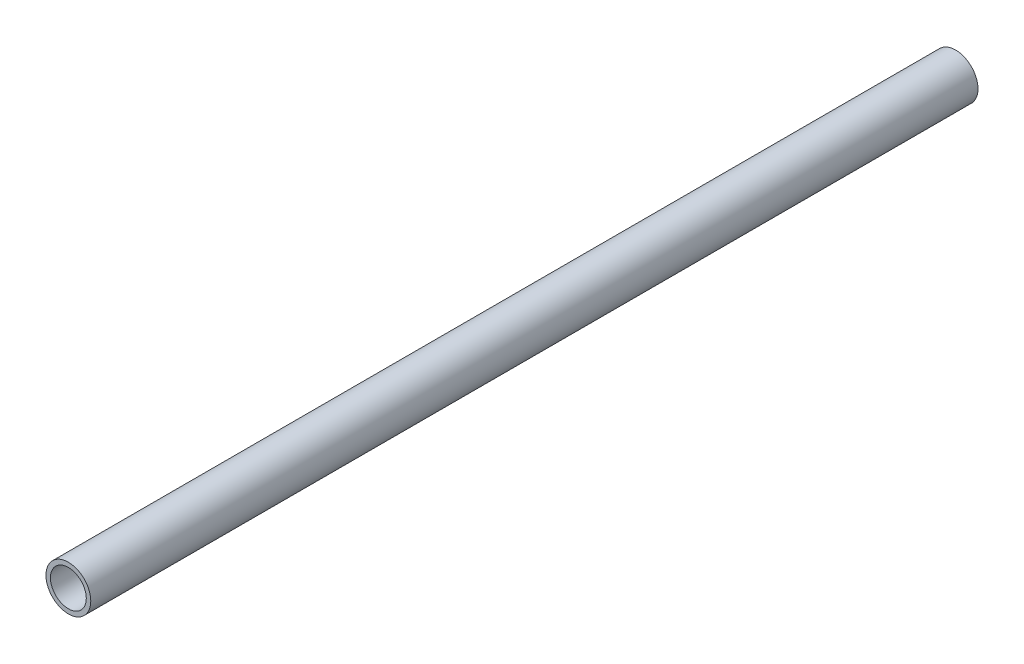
ISO-10303-21;
HEADER;
FILE_DESCRIPTION(('STEP AP214'),'2;1');
FILE_NAME('part.step','',(''),(''),'','','');
FILE_SCHEMA(('AUTOMOTIVE_DESIGN { 1 0 10303 214 1 1 1 1 }'));
ENDSEC;
DATA;
#1=APPLICATION_CONTEXT('core data for automotive mechanical design processes');
#2=APPLICATION_PROTOCOL_DEFINITION('international standard','automotive_design',2000,#1);
#3=PRODUCT_CONTEXT('',#1,'mechanical');
#4=PRODUCT('Part','Part','',(#3));
#5=PRODUCT_RELATED_PRODUCT_CATEGORY('part','',(#4));
#6=PRODUCT_DEFINITION_FORMATION('','',#4);
#7=PRODUCT_DEFINITION_CONTEXT('part definition',#1,'design');
#8=PRODUCT_DEFINITION('design','',#6,#7);
#9=PRODUCT_DEFINITION_SHAPE('','',#8);
#10=(LENGTH_UNIT() NAMED_UNIT(*) SI_UNIT(.MILLI.,.METRE.));
#11=(NAMED_UNIT(*) PLANE_ANGLE_UNIT() SI_UNIT($,.RADIAN.));
#12=(NAMED_UNIT(*) SI_UNIT($,.STERADIAN.) SOLID_ANGLE_UNIT());
#13=UNCERTAINTY_MEASURE_WITH_UNIT(LENGTH_MEASURE(1.E-05),#10,'distance_accuracy_value','');
#14=(GEOMETRIC_REPRESENTATION_CONTEXT(3) GLOBAL_UNCERTAINTY_ASSIGNED_CONTEXT((#13)) GLOBAL_UNIT_ASSIGNED_CONTEXT((#10,
#11,#12)) REPRESENTATION_CONTEXT('',''));
#15=CARTESIAN_POINT('',(0.,0.,0.));
#16=DIRECTION('',(0.,0.,1.));
#17=DIRECTION('',(1.,0.,0.));
#18=AXIS2_PLACEMENT_3D('',#15,#16,#17);
#19=CARTESIAN_POINT('',(0.,0.,314.325));
#20=DIRECTION('',(0.,0.,1.));
#21=DIRECTION('',(1.,0.,0.));
#22=AXIS2_PLACEMENT_3D('',#19,#20,#21);
#23=PLANE('',#22);
#24=CARTESIAN_POINT('',(0.,0.,314.325));
#25=DIRECTION('',(0.,0.,1.));
#26=DIRECTION('',(1.,0.,0.));
#27=AXIS2_PLACEMENT_3D('',#24,#25,#26);
#28=CIRCLE('',#27,15.875);
#29=CARTESIAN_POINT('',(15.875,0.,314.325));
#30=VERTEX_POINT('',#29);
#31=EDGE_CURVE('E10',#30,#30,#28,.T.);
#32=ORIENTED_EDGE('',*,*,#31,.T.);
#33=EDGE_LOOP('',(#32));
#34=FACE_BOUND('',#33,.T.);
#35=CARTESIAN_POINT('',(0.,0.,314.325));
#36=DIRECTION('',(0.,0.,1.));
#37=DIRECTION('',(1.,0.,0.));
#38=AXIS2_PLACEMENT_3D('',#35,#36,#37);
#39=CIRCLE('',#38,12.7);
#40=CARTESIAN_POINT('',(12.7,0.,314.325));
#41=VERTEX_POINT('',#40);
#42=EDGE_CURVE('E44',#41,#41,#39,.T.);
#43=ORIENTED_EDGE('',*,*,#42,.F.);
#44=EDGE_LOOP('',(#43));
#45=FACE_BOUND('',#44,.T.);
#46=ADVANCED_FACE('F33',(#34,#45),#23,.T.);
#47=CARTESIAN_POINT('',(0.,0.,-314.325));
#48=DIRECTION('',(0.,0.,1.));
#49=DIRECTION('',(1.,0.,0.));
#50=AXIS2_PLACEMENT_3D('',#47,#48,#49);
#51=PLANE('',#50);
#52=CARTESIAN_POINT('',(0.,0.,-314.325));
#53=DIRECTION('',(0.,0.,1.));
#54=DIRECTION('',(1.,0.,0.));
#55=AXIS2_PLACEMENT_3D('',#52,#53,#54);
#56=CIRCLE('',#55,15.875);
#57=CARTESIAN_POINT('',(15.875,0.,-314.325));
#58=VERTEX_POINT('',#57);
#59=EDGE_CURVE('E37',#58,#58,#56,.T.);
#60=ORIENTED_EDGE('',*,*,#59,.F.);
#61=EDGE_LOOP('',(#60));
#62=FACE_BOUND('',#61,.T.);
#63=CARTESIAN_POINT('',(0.,0.,-314.325));
#64=DIRECTION('',(0.,0.,1.));
#65=DIRECTION('',(1.,0.,0.));
#66=AXIS2_PLACEMENT_3D('',#63,#64,#65);
#67=CIRCLE('',#66,12.7);
#68=CARTESIAN_POINT('',(12.7,0.,-314.325));
#69=VERTEX_POINT('',#68);
#70=EDGE_CURVE('E46',#69,#69,#67,.T.);
#71=ORIENTED_EDGE('',*,*,#70,.T.);
#72=EDGE_LOOP('',(#71));
#73=FACE_BOUND('',#72,.T.);
#74=ADVANCED_FACE('F56',(#62,#73),#51,.F.);
#75=CARTESIAN_POINT('',(0.,0.,314.325));
#76=DIRECTION('',(0.,0.,-1.));
#77=DIRECTION('',(-1.,0.,0.));
#78=AXIS2_PLACEMENT_3D('',#75,#76,#77);
#79=CYLINDRICAL_SURFACE('',#78,15.875);
#80=ORIENTED_EDGE('',*,*,#31,.F.);
#81=EDGE_LOOP('',(#80));
#82=FACE_BOUND('',#81,.T.);
#83=ORIENTED_EDGE('',*,*,#59,.T.);
#84=EDGE_LOOP('',(#83));
#85=FACE_BOUND('',#84,.T.);
#86=ADVANCED_FACE('F35',(#82,#85),#79,.T.);
#87=CARTESIAN_POINT('',(0.,0.,314.325));
#88=DIRECTION('',(0.,0.,-1.));
#89=DIRECTION('',(-1.,0.,0.));
#90=AXIS2_PLACEMENT_3D('',#87,#88,#89);
#91=CYLINDRICAL_SURFACE('',#90,12.7);
#92=ORIENTED_EDGE('',*,*,#42,.T.);
#93=EDGE_LOOP('',(#92));
#94=FACE_BOUND('',#93,.T.);
#95=ORIENTED_EDGE('',*,*,#70,.F.);
#96=EDGE_LOOP('',(#95));
#97=FACE_BOUND('',#96,.T.);
#98=ADVANCED_FACE('F52',(#94,#97),#91,.F.);
#99=CLOSED_SHELL('',(#46,#74,#86,#98));
#100=MANIFOLD_SOLID_BREP('B2',#99);
#101=ADVANCED_BREP_SHAPE_REPRESENTATION('',(#18,#100),#14);
#102=SHAPE_DEFINITION_REPRESENTATION(#9,#101);
ENDSEC;
END-ISO-10303-21;
